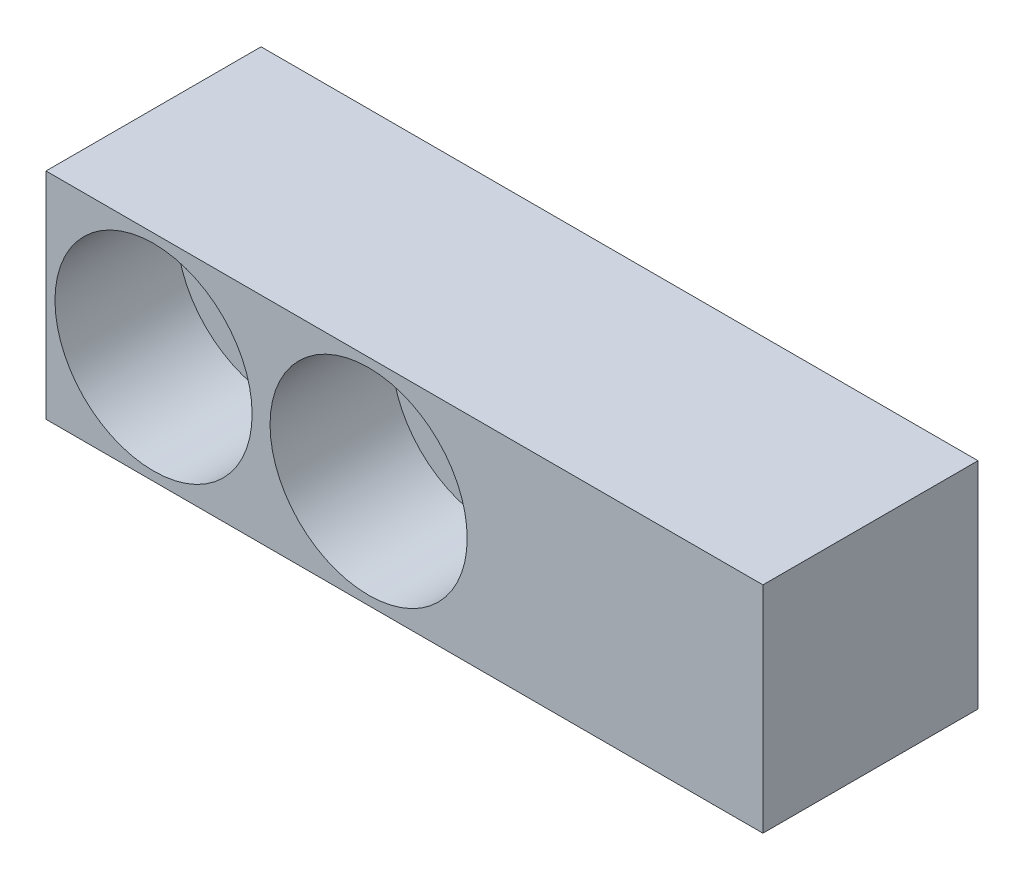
ISO-10303-21;
HEADER;
FILE_DESCRIPTION(('STEP AP214'),'2;1');
FILE_NAME('part.step','',(''),(''),'','','');
FILE_SCHEMA(('AUTOMOTIVE_DESIGN { 1 0 10303 214 1 1 1 1 }'));
ENDSEC;
DATA;
#1=APPLICATION_CONTEXT('core data for automotive mechanical design processes');
#2=APPLICATION_PROTOCOL_DEFINITION('international standard','automotive_design',2000,#1);
#3=PRODUCT_CONTEXT('',#1,'mechanical');
#4=PRODUCT('Part','Part','',(#3));
#5=PRODUCT_RELATED_PRODUCT_CATEGORY('part','',(#4));
#6=PRODUCT_DEFINITION_FORMATION('','',#4);
#7=PRODUCT_DEFINITION_CONTEXT('part definition',#1,'design');
#8=PRODUCT_DEFINITION('design','',#6,#7);
#9=PRODUCT_DEFINITION_SHAPE('','',#8);
#10=(LENGTH_UNIT() NAMED_UNIT(*) SI_UNIT(.MILLI.,.METRE.));
#11=(NAMED_UNIT(*) PLANE_ANGLE_UNIT() SI_UNIT($,.RADIAN.));
#12=(NAMED_UNIT(*) SI_UNIT($,.STERADIAN.) SOLID_ANGLE_UNIT());
#13=UNCERTAINTY_MEASURE_WITH_UNIT(LENGTH_MEASURE(1.E-05),#10,'distance_accuracy_value','');
#14=(GEOMETRIC_REPRESENTATION_CONTEXT(3) GLOBAL_UNCERTAINTY_ASSIGNED_CONTEXT((#13)) GLOBAL_UNIT_ASSIGNED_CONTEXT((#10,
#11,#12)) REPRESENTATION_CONTEXT('',''));
#15=CARTESIAN_POINT('',(0.,0.,0.));
#16=DIRECTION('',(0.,0.,1.));
#17=DIRECTION('',(1.,0.,0.));
#18=AXIS2_PLACEMENT_3D('',#15,#16,#17);
#19=CARTESIAN_POINT('',(68.9169387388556,145.,12.));
#20=DIRECTION('',(1.,0.,0.));
#21=DIRECTION('',(0.,0.,-1.));
#22=AXIS2_PLACEMENT_3D('',#19,#20,#21);
#23=PLANE('',#22);
#24=DIRECTION('',(0.,-1.,0.));
#25=VECTOR('',#24,1.);
#26=CARTESIAN_POINT('',(68.9169387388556,145.,0.));
#27=LINE('',#26,#25);
#28=CARTESIAN_POINT('',(68.9169387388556,157.,0.));
#29=VERTEX_POINT('',#28);
#30=CARTESIAN_POINT('',(68.9169387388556,145.,0.));
#31=VERTEX_POINT('',#30);
#32=EDGE_CURVE('E79',#29,#31,#27,.T.);
#33=ORIENTED_EDGE('',*,*,#32,.T.);
#34=DIRECTION('',(0.,0.,-1.));
#35=VECTOR('',#34,1.);
#36=CARTESIAN_POINT('',(68.9169387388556,145.,12.));
#37=LINE('',#36,#35);
#38=CARTESIAN_POINT('',(68.9169387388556,145.,12.));
#39=VERTEX_POINT('',#38);
#40=EDGE_CURVE('E11',#39,#31,#37,.T.);
#41=ORIENTED_EDGE('',*,*,#40,.F.);
#42=DIRECTION('',(0.,-1.,0.));
#43=VECTOR('',#42,1.);
#44=CARTESIAN_POINT('',(68.9169387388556,145.,12.));
#45=LINE('',#44,#43);
#46=CARTESIAN_POINT('',(68.9169387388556,157.,12.));
#47=VERTEX_POINT('',#46);
#48=EDGE_CURVE('E67',#47,#39,#45,.T.);
#49=ORIENTED_EDGE('',*,*,#48,.F.);
#50=DIRECTION('',(0.,0.,-1.));
#51=VECTOR('',#50,1.);
#52=CARTESIAN_POINT('',(68.9169387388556,157.,12.));
#53=LINE('',#52,#51);
#54=EDGE_CURVE('E75',#47,#29,#53,.T.);
#55=ORIENTED_EDGE('',*,*,#54,.T.);
#56=EDGE_LOOP('',(#33,#41,#49,#55));
#57=FACE_BOUND('',#56,.T.);
#58=ADVANCED_FACE('F16',(#57),#23,.F.);
#59=CARTESIAN_POINT('',(68.9169387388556,145.,12.));
#60=DIRECTION('',(0.,1.,0.));
#61=DIRECTION('',(0.,0.,1.));
#62=AXIS2_PLACEMENT_3D('',#59,#60,#61);
#63=PLANE('',#62);
#64=DIRECTION('',(1.,0.,0.));
#65=VECTOR('',#64,1.);
#66=CARTESIAN_POINT('',(68.9169387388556,145.,0.));
#67=LINE('',#66,#65);
#68=CARTESIAN_POINT('',(108.916938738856,145.,0.));
#69=VERTEX_POINT('',#68);
#70=EDGE_CURVE('E71',#31,#69,#67,.T.);
#71=ORIENTED_EDGE('',*,*,#70,.T.);
#72=DIRECTION('',(0.,0.,-1.));
#73=VECTOR('',#72,1.);
#74=CARTESIAN_POINT('',(108.916938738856,145.,12.));
#75=LINE('',#74,#73);
#76=CARTESIAN_POINT('',(108.916938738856,145.,12.));
#77=VERTEX_POINT('',#76);
#78=EDGE_CURVE('E24',#77,#69,#75,.T.);
#79=ORIENTED_EDGE('',*,*,#78,.F.);
#80=DIRECTION('',(1.,0.,0.));
#81=VECTOR('',#80,1.);
#82=CARTESIAN_POINT('',(68.9169387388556,145.,12.));
#83=LINE('',#82,#81);
#84=EDGE_CURVE('E62',#39,#77,#83,.T.);
#85=ORIENTED_EDGE('',*,*,#84,.F.);
#86=ORIENTED_EDGE('',*,*,#40,.T.);
#87=EDGE_LOOP('',(#71,#79,#85,#86));
#88=FACE_BOUND('',#87,.T.);
#89=ADVANCED_FACE('F70',(#88),#63,.F.);
#90=CARTESIAN_POINT('',(108.916938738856,145.,12.));
#91=DIRECTION('',(-1.,0.,0.));
#92=DIRECTION('',(0.,0.,1.));
#93=AXIS2_PLACEMENT_3D('',#90,#91,#92);
#94=PLANE('',#93);
#95=DIRECTION('',(0.,1.,0.));
#96=VECTOR('',#95,1.);
#97=CARTESIAN_POINT('',(108.916938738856,145.,0.));
#98=LINE('',#97,#96);
#99=CARTESIAN_POINT('',(108.916938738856,157.,0.));
#100=VERTEX_POINT('',#99);
#101=EDGE_CURVE('E49',#69,#100,#98,.T.);
#102=ORIENTED_EDGE('',*,*,#101,.T.);
#103=DIRECTION('',(0.,0.,-1.));
#104=VECTOR('',#103,1.);
#105=CARTESIAN_POINT('',(108.916938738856,157.,12.));
#106=LINE('',#105,#104);
#107=CARTESIAN_POINT('',(108.916938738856,157.,12.));
#108=VERTEX_POINT('',#107);
#109=EDGE_CURVE('E72',#108,#100,#106,.T.);
#110=ORIENTED_EDGE('',*,*,#109,.F.);
#111=DIRECTION('',(0.,1.,0.));
#112=VECTOR('',#111,1.);
#113=CARTESIAN_POINT('',(108.916938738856,145.,12.));
#114=LINE('',#113,#112);
#115=EDGE_CURVE('E65',#77,#108,#114,.T.);
#116=ORIENTED_EDGE('',*,*,#115,.F.);
#117=ORIENTED_EDGE('',*,*,#78,.T.);
#118=EDGE_LOOP('',(#102,#110,#116,#117));
#119=FACE_BOUND('',#118,.T.);
#120=ADVANCED_FACE('F73',(#119),#94,.F.);
#121=CARTESIAN_POINT('',(68.9169387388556,157.,12.));
#122=DIRECTION('',(0.,-1.,0.));
#123=DIRECTION('',(0.,0.,-1.));
#124=AXIS2_PLACEMENT_3D('',#121,#122,#123);
#125=PLANE('',#124);
#126=DIRECTION('',(-1.,0.,0.));
#127=VECTOR('',#126,1.);
#128=CARTESIAN_POINT('',(68.9169387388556,157.,0.));
#129=LINE('',#128,#127);
#130=EDGE_CURVE('E55',#100,#29,#129,.T.);
#131=ORIENTED_EDGE('',*,*,#130,.T.);
#132=ORIENTED_EDGE('',*,*,#54,.F.);
#133=DIRECTION('',(-1.,0.,0.));
#134=VECTOR('',#133,1.);
#135=CARTESIAN_POINT('',(68.9169387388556,157.,12.));
#136=LINE('',#135,#134);
#137=EDGE_CURVE('E32',#108,#47,#136,.T.);
#138=ORIENTED_EDGE('',*,*,#137,.F.);
#139=ORIENTED_EDGE('',*,*,#109,.T.);
#140=EDGE_LOOP('',(#131,#132,#138,#139));
#141=FACE_BOUND('',#140,.T.);
#142=ADVANCED_FACE('F87',(#141),#125,.F.);
#143=CARTESIAN_POINT('',(0.,0.,12.));
#144=DIRECTION('',(0.,0.,-1.));
#145=DIRECTION('',(-1.,0.,0.));
#146=AXIS2_PLACEMENT_3D('',#143,#144,#145);
#147=PLANE('',#146);
#148=CARTESIAN_POINT('',(74.9169387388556,151.,12.));
#149=DIRECTION('',(0.,0.,1.));
#150=DIRECTION('',(1.,0.,0.));
#151=AXIS2_PLACEMENT_3D('',#148,#149,#150);
#152=CIRCLE('',#151,5.5);
#153=CARTESIAN_POINT('',(80.4169387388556,151.,12.));
#154=VERTEX_POINT('',#153);
#155=EDGE_CURVE('E113',#154,#154,#152,.T.);
#156=ORIENTED_EDGE('',*,*,#155,.F.);
#157=EDGE_LOOP('',(#156));
#158=FACE_BOUND('',#157,.T.);
#159=CARTESIAN_POINT('',(86.9169387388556,151.,12.));
#160=DIRECTION('',(0.,0.,1.));
#161=DIRECTION('',(1.,0.,0.));
#162=AXIS2_PLACEMENT_3D('',#159,#160,#161);
#163=CIRCLE('',#162,5.5);
#164=CARTESIAN_POINT('',(92.4169387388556,151.,12.));
#165=VERTEX_POINT('',#164);
#166=EDGE_CURVE('E101',#165,#165,#163,.T.);
#167=ORIENTED_EDGE('',*,*,#166,.F.);
#168=EDGE_LOOP('',(#167));
#169=FACE_BOUND('',#168,.T.);
#170=ORIENTED_EDGE('',*,*,#48,.T.);
#171=ORIENTED_EDGE('',*,*,#84,.T.);
#172=ORIENTED_EDGE('',*,*,#115,.T.);
#173=ORIENTED_EDGE('',*,*,#137,.T.);
#174=EDGE_LOOP('',(#170,#171,#172,#173));
#175=FACE_BOUND('',#174,.T.);
#176=ADVANCED_FACE('F63',(#158,#169,#175),#147,.F.);
#177=CARTESIAN_POINT('',(0.,0.,0.));
#178=DIRECTION('',(0.,0.,-1.));
#179=DIRECTION('',(-1.,0.,0.));
#180=AXIS2_PLACEMENT_3D('',#177,#178,#179);
#181=PLANE('',#180);
#182=CARTESIAN_POINT('',(74.9169387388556,151.,0.));
#183=DIRECTION('',(0.,0.,1.));
#184=DIRECTION('',(1.,0.,0.));
#185=AXIS2_PLACEMENT_3D('',#182,#183,#184);
#186=CIRCLE('',#185,3.3);
#187=CARTESIAN_POINT('',(78.2169387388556,151.,0.));
#188=VERTEX_POINT('',#187);
#189=EDGE_CURVE('E104',#188,#188,#186,.T.);
#190=ORIENTED_EDGE('',*,*,#189,.T.);
#191=EDGE_LOOP('',(#190));
#192=FACE_BOUND('',#191,.T.);
#193=CARTESIAN_POINT('',(86.9169387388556,151.,0.));
#194=DIRECTION('',(0.,0.,1.));
#195=DIRECTION('',(1.,0.,0.));
#196=AXIS2_PLACEMENT_3D('',#193,#194,#195);
#197=CIRCLE('',#196,3.3);
#198=CARTESIAN_POINT('',(90.2169387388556,151.,0.));
#199=VERTEX_POINT('',#198);
#200=EDGE_CURVE('E82',#199,#199,#197,.T.);
#201=ORIENTED_EDGE('',*,*,#200,.T.);
#202=EDGE_LOOP('',(#201));
#203=FACE_BOUND('',#202,.T.);
#204=ORIENTED_EDGE('',*,*,#32,.F.);
#205=ORIENTED_EDGE('',*,*,#130,.F.);
#206=ORIENTED_EDGE('',*,*,#101,.F.);
#207=ORIENTED_EDGE('',*,*,#70,.F.);
#208=EDGE_LOOP('',(#204,#205,#206,#207));
#209=FACE_BOUND('',#208,.T.);
#210=ADVANCED_FACE('F90',(#192,#203,#209),#181,.T.);
#211=CARTESIAN_POINT('',(86.9169387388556,151.,12.));
#212=DIRECTION('',(0.,0.,1.));
#213=DIRECTION('',(1.,0.,0.));
#214=AXIS2_PLACEMENT_3D('',#211,#212,#213);
#215=CYLINDRICAL_SURFACE('',#214,3.3);
#216=ORIENTED_EDGE('',*,*,#200,.F.);
#217=EDGE_LOOP('',(#216));
#218=FACE_BOUND('',#217,.T.);
#219=CARTESIAN_POINT('',(86.9169387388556,151.,5.2));
#220=DIRECTION('',(0.,0.,1.));
#221=DIRECTION('',(1.,0.,0.));
#222=AXIS2_PLACEMENT_3D('',#219,#220,#221);
#223=CIRCLE('',#222,3.3);
#224=CARTESIAN_POINT('',(90.2169387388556,151.,5.2));
#225=VERTEX_POINT('',#224);
#226=EDGE_CURVE('E95',#225,#225,#223,.T.);
#227=ORIENTED_EDGE('',*,*,#226,.T.);
#228=EDGE_LOOP('',(#227));
#229=FACE_BOUND('',#228,.T.);
#230=ADVANCED_FACE('F139',(#218,#229),#215,.F.);
#231=CARTESIAN_POINT('',(90.2169387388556,151.,5.2));
#232=DIRECTION('',(0.,0.,-1.));
#233=DIRECTION('',(-1.,0.,0.));
#234=AXIS2_PLACEMENT_3D('',#231,#232,#233);
#235=PLANE('',#234);
#236=ORIENTED_EDGE('',*,*,#226,.F.);
#237=EDGE_LOOP('',(#236));
#238=FACE_BOUND('',#237,.T.);
#239=CARTESIAN_POINT('',(86.9169387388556,151.,5.2));
#240=DIRECTION('',(0.,0.,1.));
#241=DIRECTION('',(1.,0.,0.));
#242=AXIS2_PLACEMENT_3D('',#239,#240,#241);
#243=CIRCLE('',#242,5.5);
#244=CARTESIAN_POINT('',(92.4169387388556,151.,5.2));
#245=VERTEX_POINT('',#244);
#246=EDGE_CURVE('E98',#245,#245,#243,.T.);
#247=ORIENTED_EDGE('',*,*,#246,.T.);
#248=EDGE_LOOP('',(#247));
#249=FACE_BOUND('',#248,.T.);
#250=ADVANCED_FACE('F127',(#238,#249),#235,.F.);
#251=CARTESIAN_POINT('',(86.9169387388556,151.,12.));
#252=DIRECTION('',(0.,0.,1.));
#253=DIRECTION('',(1.,0.,0.));
#254=AXIS2_PLACEMENT_3D('',#251,#252,#253);
#255=CYLINDRICAL_SURFACE('',#254,5.5);
#256=ORIENTED_EDGE('',*,*,#246,.F.);
#257=EDGE_LOOP('',(#256));
#258=FACE_BOUND('',#257,.T.);
#259=ORIENTED_EDGE('',*,*,#166,.T.);
#260=EDGE_LOOP('',(#259));
#261=FACE_BOUND('',#260,.T.);
#262=ADVANCED_FACE('F124',(#258,#261),#255,.F.);
#263=CARTESIAN_POINT('',(74.9169387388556,151.,12.));
#264=DIRECTION('',(0.,0.,1.));
#265=DIRECTION('',(1.,0.,0.));
#266=AXIS2_PLACEMENT_3D('',#263,#264,#265);
#267=CYLINDRICAL_SURFACE('',#266,3.3);
#268=ORIENTED_EDGE('',*,*,#189,.F.);
#269=EDGE_LOOP('',(#268));
#270=FACE_BOUND('',#269,.T.);
#271=CARTESIAN_POINT('',(74.9169387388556,151.,5.2));
#272=DIRECTION('',(0.,0.,1.));
#273=DIRECTION('',(1.,0.,0.));
#274=AXIS2_PLACEMENT_3D('',#271,#272,#273);
#275=CIRCLE('',#274,3.3);
#276=CARTESIAN_POINT('',(78.2169387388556,151.,5.2));
#277=VERTEX_POINT('',#276);
#278=EDGE_CURVE('E107',#277,#277,#275,.T.);
#279=ORIENTED_EDGE('',*,*,#278,.T.);
#280=EDGE_LOOP('',(#279));
#281=FACE_BOUND('',#280,.T.);
#282=ADVANCED_FACE('F126',(#270,#281),#267,.F.);
#283=CARTESIAN_POINT('',(78.2169387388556,151.,5.2));
#284=DIRECTION('',(0.,0.,-1.));
#285=DIRECTION('',(-1.,0.,0.));
#286=AXIS2_PLACEMENT_3D('',#283,#284,#285);
#287=PLANE('',#286);
#288=ORIENTED_EDGE('',*,*,#278,.F.);
#289=EDGE_LOOP('',(#288));
#290=FACE_BOUND('',#289,.T.);
#291=CARTESIAN_POINT('',(74.9169387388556,151.,5.2));
#292=DIRECTION('',(0.,0.,1.));
#293=DIRECTION('',(1.,0.,0.));
#294=AXIS2_PLACEMENT_3D('',#291,#292,#293);
#295=CIRCLE('',#294,5.5);
#296=CARTESIAN_POINT('',(80.4169387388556,151.,5.2));
#297=VERTEX_POINT('',#296);
#298=EDGE_CURVE('E110',#297,#297,#295,.T.);
#299=ORIENTED_EDGE('',*,*,#298,.T.);
#300=EDGE_LOOP('',(#299));
#301=FACE_BOUND('',#300,.T.);
#302=ADVANCED_FACE('F136',(#290,#301),#287,.F.);
#303=CARTESIAN_POINT('',(74.9169387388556,151.,12.));
#304=DIRECTION('',(0.,0.,1.));
#305=DIRECTION('',(1.,0.,0.));
#306=AXIS2_PLACEMENT_3D('',#303,#304,#305);
#307=CYLINDRICAL_SURFACE('',#306,5.5);
#308=ORIENTED_EDGE('',*,*,#298,.F.);
#309=EDGE_LOOP('',(#308));
#310=FACE_BOUND('',#309,.T.);
#311=ORIENTED_EDGE('',*,*,#155,.T.);
#312=EDGE_LOOP('',(#311));
#313=FACE_BOUND('',#312,.T.);
#314=ADVANCED_FACE('F117',(#310,#313),#307,.F.);
#315=CLOSED_SHELL('',(#58,#89,#120,#142,#176,#210,#230,#250,#262,#282,#302,#314));
#316=MANIFOLD_SOLID_BREP('B1',#315);
#317=ADVANCED_BREP_SHAPE_REPRESENTATION('',(#18,#316),#14);
#318=SHAPE_DEFINITION_REPRESENTATION(#9,#317);
ENDSEC;
END-ISO-10303-21;
